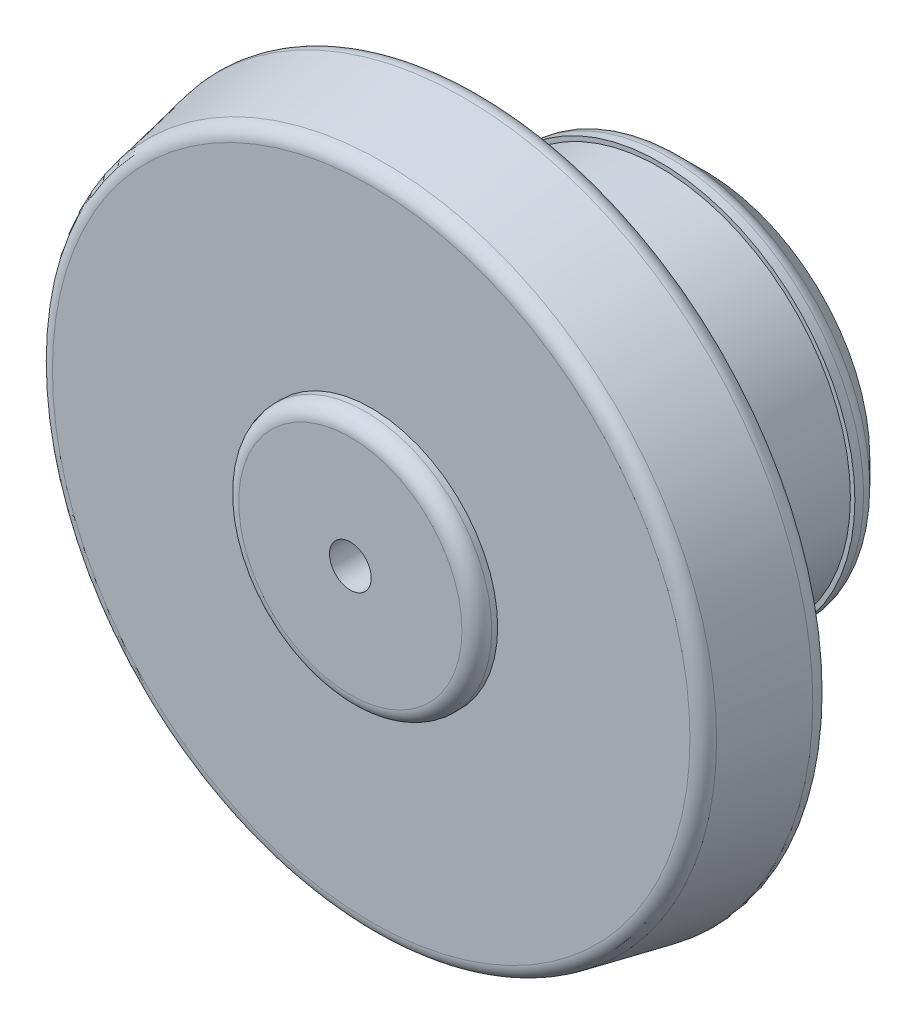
ISO-10303-21;
HEADER;
FILE_DESCRIPTION(('STEP AP214'),'2;1');
FILE_NAME('part.step','',(''),(''),'','','');
FILE_SCHEMA(('AUTOMOTIVE_DESIGN { 1 0 10303 214 1 1 1 1 }'));
ENDSEC;
DATA;
#1=APPLICATION_CONTEXT('core data for automotive mechanical design processes');
#2=APPLICATION_PROTOCOL_DEFINITION('international standard','automotive_design',2000,#1);
#3=PRODUCT_CONTEXT('',#1,'mechanical');
#4=PRODUCT('Part','Part','',(#3));
#5=PRODUCT_RELATED_PRODUCT_CATEGORY('part','',(#4));
#6=PRODUCT_DEFINITION_FORMATION('','',#4);
#7=PRODUCT_DEFINITION_CONTEXT('part definition',#1,'design');
#8=PRODUCT_DEFINITION('design','',#6,#7);
#9=PRODUCT_DEFINITION_SHAPE('','',#8);
#10=(LENGTH_UNIT() NAMED_UNIT(*) SI_UNIT(.MILLI.,.METRE.));
#11=(NAMED_UNIT(*) PLANE_ANGLE_UNIT() SI_UNIT($,.RADIAN.));
#12=(NAMED_UNIT(*) SI_UNIT($,.STERADIAN.) SOLID_ANGLE_UNIT());
#13=UNCERTAINTY_MEASURE_WITH_UNIT(LENGTH_MEASURE(1.E-05),#10,'distance_accuracy_value','');
#14=(GEOMETRIC_REPRESENTATION_CONTEXT(3) GLOBAL_UNCERTAINTY_ASSIGNED_CONTEXT((#13)) GLOBAL_UNIT_ASSIGNED_CONTEXT((#10,
#11,#12)) REPRESENTATION_CONTEXT('',''));
#15=CARTESIAN_POINT('',(0.,0.,0.));
#16=DIRECTION('',(0.,0.,1.));
#17=DIRECTION('',(1.,0.,0.));
#18=AXIS2_PLACEMENT_3D('',#15,#16,#17);
#19=CARTESIAN_POINT('',(0.,0.,7.));
#20=DIRECTION('',(0.,0.,-1.));
#21=DIRECTION('',(-1.,0.,0.));
#22=AXIS2_PLACEMENT_3D('',#19,#20,#21);
#23=PLANE('',#22);
#24=CARTESIAN_POINT('',(0.,0.,7.));
#25=DIRECTION('',(0.,0.,-1.));
#26=DIRECTION('',(-1.,0.,0.));
#27=AXIS2_PLACEMENT_3D('',#24,#25,#26);
#28=CIRCLE('',#27,5.);
#29=CARTESIAN_POINT('',(4.99774949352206,-0.15,7.));
#30=VERTEX_POINT('',#29);
#31=CARTESIAN_POINT('',(0.150000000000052,-4.99774949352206,7.));
#32=VERTEX_POINT('',#31);
#33=EDGE_CURVE('E237',#30,#32,#28,.T.);
#34=ORIENTED_EDGE('',*,*,#33,.T.);
#35=DIRECTION('',(0.,1.,0.));
#36=VECTOR('',#35,1.);
#37=CARTESIAN_POINT('',(0.15,0.,7.));
#38=LINE('',#37,#36);
#39=CARTESIAN_POINT('',(0.150000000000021,-1.99436706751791,7.));
#40=VERTEX_POINT('',#39);
#41=EDGE_CURVE('E161',#32,#40,#38,.T.);
#42=ORIENTED_EDGE('',*,*,#41,.T.);
#43=CARTESIAN_POINT('',(0.,0.,7.));
#44=DIRECTION('',(0.,0.,-1.));
#45=DIRECTION('',(-1.,0.,0.));
#46=AXIS2_PLACEMENT_3D('',#43,#44,#45);
#47=CIRCLE('',#46,2.);
#48=CARTESIAN_POINT('',(1.99436706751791,-0.15,7.));
#49=VERTEX_POINT('',#48);
#50=EDGE_CURVE('E225',#49,#40,#47,.T.);
#51=ORIENTED_EDGE('',*,*,#50,.F.);
#52=DIRECTION('',(-1.,0.,0.));
#53=VECTOR('',#52,1.);
#54=CARTESIAN_POINT('',(0.,-0.15,7.));
#55=LINE('',#54,#53);
#56=EDGE_CURVE('E209',#30,#49,#55,.T.);
#57=ORIENTED_EDGE('',*,*,#56,.F.);
#58=EDGE_LOOP('',(#34,#42,#51,#57));
#59=FACE_BOUND('',#58,.T.);
#60=ADVANCED_FACE('F27',(#59),#23,.T.);
#61=CARTESIAN_POINT('',(0.,0.,7.));
#62=DIRECTION('',(0.,0.,-1.));
#63=DIRECTION('',(-1.,0.,0.));
#64=AXIS2_PLACEMENT_3D('',#61,#62,#63);
#65=CYLINDRICAL_SURFACE('',#64,5.);
#66=CARTESIAN_POINT('',(0.,0.,0.));
#67=DIRECTION('',(0.,0.,-1.));
#68=DIRECTION('',(-1.,0.,0.));
#69=AXIS2_PLACEMENT_3D('',#66,#67,#68);
#70=CIRCLE('',#69,5.);
#71=CARTESIAN_POINT('',(-5.,0.,0.));
#72=VERTEX_POINT('',#71);
#73=EDGE_CURVE('E233',#72,#72,#70,.T.);
#74=ORIENTED_EDGE('',*,*,#73,.T.);
#75=EDGE_LOOP('',(#74));
#76=FACE_BOUND('',#75,.T.);
#77=DIRECTION('',(0.,0.,-1.));
#78=VECTOR('',#77,1.);
#79=CARTESIAN_POINT('',(0.150000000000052,-4.99774949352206,7.));
#80=LINE('',#79,#78);
#81=CARTESIAN_POINT('',(0.150000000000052,-4.99774949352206,1.66008855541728));
#82=VERTEX_POINT('',#81);
#83=EDGE_CURVE('E151',#32,#82,#80,.T.);
#84=ORIENTED_EDGE('',*,*,#83,.F.);
#85=ORIENTED_EDGE('',*,*,#33,.F.);
#86=DIRECTION('',(0.,0.,-1.));
#87=VECTOR('',#86,1.);
#88=CARTESIAN_POINT('',(4.99774949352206,-0.15,7.));
#89=LINE('',#88,#87);
#90=CARTESIAN_POINT('',(4.99774949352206,-0.15,1.66008855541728));
#91=VERTEX_POINT('',#90);
#92=EDGE_CURVE('E211',#30,#91,#89,.T.);
#93=ORIENTED_EDGE('',*,*,#92,.T.);
#94=CARTESIAN_POINT('',(0.,0.,1.66008855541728));
#95=DIRECTION('',(0.,0.,1.));
#96=DIRECTION('',(1.,0.,0.));
#97=AXIS2_PLACEMENT_3D('',#94,#95,#96);
#98=CIRCLE('',#97,5.);
#99=CARTESIAN_POINT('',(4.99774949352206,0.15,1.66008855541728));
#100=VERTEX_POINT('',#99);
#101=EDGE_CURVE('E219',#100,#91,#98,.F.);
#102=ORIENTED_EDGE('',*,*,#101,.F.);
#103=DIRECTION('',(0.,0.,-1.));
#104=VECTOR('',#103,1.);
#105=CARTESIAN_POINT('',(4.99774949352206,0.15,7.));
#106=LINE('',#105,#104);
#107=CARTESIAN_POINT('',(4.99774949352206,0.15,7.));
#108=VERTEX_POINT('',#107);
#109=EDGE_CURVE('E217',#108,#100,#106,.T.);
#110=ORIENTED_EDGE('',*,*,#109,.F.);
#111=CARTESIAN_POINT('',(0.149999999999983,4.99774949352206,7.));
#112=VERTEX_POINT('',#111);
#113=EDGE_CURVE('E236',#112,#108,#28,.T.);
#114=ORIENTED_EDGE('',*,*,#113,.F.);
#115=DIRECTION('',(0.,0.,-1.));
#116=VECTOR('',#115,1.);
#117=CARTESIAN_POINT('',(0.149999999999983,4.99774949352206,7.));
#118=LINE('',#117,#116);
#119=CARTESIAN_POINT('',(0.149999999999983,4.99774949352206,1.66008855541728));
#120=VERTEX_POINT('',#119);
#121=EDGE_CURVE('E193',#112,#120,#118,.T.);
#122=ORIENTED_EDGE('',*,*,#121,.T.);
#123=CARTESIAN_POINT('',(0.,0.,1.66008855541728));
#124=DIRECTION('',(0.,0.,1.));
#125=DIRECTION('',(1.,0.,0.));
#126=AXIS2_PLACEMENT_3D('',#123,#124,#125);
#127=CIRCLE('',#126,5.);
#128=CARTESIAN_POINT('',(-0.150000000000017,4.99774949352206,1.66008855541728));
#129=VERTEX_POINT('',#128);
#130=EDGE_CURVE('E201',#129,#120,#127,.F.);
#131=ORIENTED_EDGE('',*,*,#130,.F.);
#132=DIRECTION('',(0.,0.,-1.));
#133=VECTOR('',#132,1.);
#134=CARTESIAN_POINT('',(-0.150000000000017,4.99774949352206,7.));
#135=LINE('',#134,#133);
#136=CARTESIAN_POINT('',(-0.150000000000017,4.99774949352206,7.));
#137=VERTEX_POINT('',#136);
#138=EDGE_CURVE('E199',#137,#129,#135,.T.);
#139=ORIENTED_EDGE('',*,*,#138,.F.);
#140=CARTESIAN_POINT('',(-4.99774949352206,0.149999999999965,7.));
#141=VERTEX_POINT('',#140);
#142=EDGE_CURVE('E337',#141,#137,#28,.T.);
#143=ORIENTED_EDGE('',*,*,#142,.F.);
#144=DIRECTION('',(0.,0.,-1.));
#145=VECTOR('',#144,1.);
#146=CARTESIAN_POINT('',(-4.99774949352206,0.149999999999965,7.));
#147=LINE('',#146,#145);
#148=CARTESIAN_POINT('',(-4.99774949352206,0.149999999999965,1.66008855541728));
#149=VERTEX_POINT('',#148);
#150=EDGE_CURVE('E175',#141,#149,#147,.T.);
#151=ORIENTED_EDGE('',*,*,#150,.T.);
#152=CARTESIAN_POINT('',(0.,0.,1.66008855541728));
#153=DIRECTION('',(0.,0.,1.));
#154=DIRECTION('',(1.,0.,0.));
#155=AXIS2_PLACEMENT_3D('',#152,#153,#154);
#156=CIRCLE('',#155,5.);
#157=CARTESIAN_POINT('',(-4.99774949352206,-0.150000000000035,1.66008855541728));
#158=VERTEX_POINT('',#157);
#159=EDGE_CURVE('E183',#158,#149,#156,.F.);
#160=ORIENTED_EDGE('',*,*,#159,.F.);
#161=DIRECTION('',(0.,0.,-1.));
#162=VECTOR('',#161,1.);
#163=CARTESIAN_POINT('',(-4.99774949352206,-0.150000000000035,7.));
#164=LINE('',#163,#162);
#165=CARTESIAN_POINT('',(-4.99774949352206,-0.150000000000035,7.));
#166=VERTEX_POINT('',#165);
#167=EDGE_CURVE('E181',#166,#158,#164,.T.);
#168=ORIENTED_EDGE('',*,*,#167,.F.);
#169=CARTESIAN_POINT('',(-0.149999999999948,-4.99774949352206,7.));
#170=VERTEX_POINT('',#169);
#171=EDGE_CURVE('E160',#170,#166,#28,.T.);
#172=ORIENTED_EDGE('',*,*,#171,.F.);
#173=DIRECTION('',(0.,0.,-1.));
#174=VECTOR('',#173,1.);
#175=CARTESIAN_POINT('',(-0.149999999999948,-4.99774949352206,7.));
#176=LINE('',#175,#174);
#177=CARTESIAN_POINT('',(-0.149999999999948,-4.99774949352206,1.66008855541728));
#178=VERTEX_POINT('',#177);
#179=EDGE_CURVE('E154',#170,#178,#176,.T.);
#180=ORIENTED_EDGE('',*,*,#179,.T.);
#181=CARTESIAN_POINT('',(0.,0.,1.66008855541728));
#182=DIRECTION('',(0.,0.,1.));
#183=DIRECTION('',(1.,0.,0.));
#184=AXIS2_PLACEMENT_3D('',#181,#182,#183);
#185=CIRCLE('',#184,5.);
#186=EDGE_CURVE('E140',#82,#178,#185,.F.);
#187=ORIENTED_EDGE('',*,*,#186,.F.);
#188=EDGE_LOOP('',(#84,#85,#93,#102,#110,#114,#122,#131,#139,#143,#151,#160,#168,#172,#180,#187));
#189=FACE_BOUND('',#188,.T.);
#190=ADVANCED_FACE('F158',(#76,#189),#65,.F.);
#191=CARTESIAN_POINT('',(0.,0.,1.));
#192=DIRECTION('',(0.,0.,1.));
#193=DIRECTION('',(1.,0.,0.));
#194=AXIS2_PLACEMENT_3D('',#191,#192,#193);
#195=CYLINDRICAL_SURFACE('',#194,2.);
#196=CARTESIAN_POINT('',(0.,0.,1.));
#197=DIRECTION('',(0.,0.,-1.));
#198=DIRECTION('',(-1.,0.,0.));
#199=AXIS2_PLACEMENT_3D('',#196,#197,#198);
#200=CIRCLE('',#199,2.);
#201=CARTESIAN_POINT('',(-2.,0.,1.));
#202=VERTEX_POINT('',#201);
#203=EDGE_CURVE('E228',#202,#202,#200,.T.);
#204=ORIENTED_EDGE('',*,*,#203,.F.);
#205=EDGE_LOOP('',(#204));
#206=FACE_BOUND('',#205,.T.);
#207=DIRECTION('',(0.,0.,1.));
#208=VECTOR('',#207,1.);
#209=CARTESIAN_POINT('',(0.150000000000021,-1.99436706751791,1.));
#210=LINE('',#209,#208);
#211=CARTESIAN_POINT('',(0.150000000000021,-1.99436706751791,1.66008855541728));
#212=VERTEX_POINT('',#211);
#213=EDGE_CURVE('E11',#212,#40,#210,.T.);
#214=ORIENTED_EDGE('',*,*,#213,.F.);
#215=CARTESIAN_POINT('',(0.,0.,1.66008855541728));
#216=DIRECTION('',(0.,0.,1.));
#217=DIRECTION('',(1.,0.,0.));
#218=AXIS2_PLACEMENT_3D('',#215,#216,#217);
#219=CIRCLE('',#218,2.);
#220=CARTESIAN_POINT('',(-0.149999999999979,-1.99436706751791,1.66008855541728));
#221=VERTEX_POINT('',#220);
#222=EDGE_CURVE('E35',#221,#212,#219,.T.);
#223=ORIENTED_EDGE('',*,*,#222,.F.);
#224=DIRECTION('',(0.,0.,1.));
#225=VECTOR('',#224,1.);
#226=CARTESIAN_POINT('',(-0.149999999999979,-1.99436706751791,1.));
#227=LINE('',#226,#225);
#228=CARTESIAN_POINT('',(-0.149999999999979,-1.99436706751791,7.));
#229=VERTEX_POINT('',#228);
#230=EDGE_CURVE('E155',#221,#229,#227,.T.);
#231=ORIENTED_EDGE('',*,*,#230,.T.);
#232=CARTESIAN_POINT('',(-1.99436706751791,-0.150000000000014,7.));
#233=VERTEX_POINT('',#232);
#234=EDGE_CURVE('E229',#229,#233,#47,.T.);
#235=ORIENTED_EDGE('',*,*,#234,.T.);
#236=DIRECTION('',(0.,0.,1.));
#237=VECTOR('',#236,1.);
#238=CARTESIAN_POINT('',(-1.99436706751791,-0.150000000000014,1.));
#239=LINE('',#238,#237);
#240=CARTESIAN_POINT('',(-1.99436706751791,-0.150000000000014,1.66008855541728));
#241=VERTEX_POINT('',#240);
#242=EDGE_CURVE('E307',#241,#233,#239,.T.);
#243=ORIENTED_EDGE('',*,*,#242,.F.);
#244=CARTESIAN_POINT('',(0.,0.,1.66008855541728));
#245=DIRECTION('',(0.,0.,1.));
#246=DIRECTION('',(1.,0.,0.));
#247=AXIS2_PLACEMENT_3D('',#244,#245,#246);
#248=CIRCLE('',#247,2.);
#249=CARTESIAN_POINT('',(-1.99436706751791,0.149999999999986,1.66008855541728));
#250=VERTEX_POINT('',#249);
#251=EDGE_CURVE('E305',#250,#241,#248,.T.);
#252=ORIENTED_EDGE('',*,*,#251,.F.);
#253=DIRECTION('',(0.,0.,1.));
#254=VECTOR('',#253,1.);
#255=CARTESIAN_POINT('',(-1.99436706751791,0.149999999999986,1.));
#256=LINE('',#255,#254);
#257=CARTESIAN_POINT('',(-1.99436706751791,0.149999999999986,7.));
#258=VERTEX_POINT('',#257);
#259=EDGE_CURVE('E303',#250,#258,#256,.T.);
#260=ORIENTED_EDGE('',*,*,#259,.T.);
#261=CARTESIAN_POINT('',(-0.150000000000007,1.99436706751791,7.));
#262=VERTEX_POINT('',#261);
#263=EDGE_CURVE('E357',#258,#262,#47,.T.);
#264=ORIENTED_EDGE('',*,*,#263,.T.);
#265=DIRECTION('',(0.,0.,1.));
#266=VECTOR('',#265,1.);
#267=CARTESIAN_POINT('',(-0.150000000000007,1.99436706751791,1.));
#268=LINE('',#267,#266);
#269=CARTESIAN_POINT('',(-0.150000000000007,1.99436706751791,1.66008855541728));
#270=VERTEX_POINT('',#269);
#271=EDGE_CURVE('E300',#270,#262,#268,.T.);
#272=ORIENTED_EDGE('',*,*,#271,.F.);
#273=CARTESIAN_POINT('',(0.,0.,1.66008855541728));
#274=DIRECTION('',(0.,0.,1.));
#275=DIRECTION('',(1.,0.,0.));
#276=AXIS2_PLACEMENT_3D('',#273,#274,#275);
#277=CIRCLE('',#276,2.);
#278=CARTESIAN_POINT('',(0.149999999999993,1.99436706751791,1.66008855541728));
#279=VERTEX_POINT('',#278);
#280=EDGE_CURVE('E298',#279,#270,#277,.T.);
#281=ORIENTED_EDGE('',*,*,#280,.F.);
#282=DIRECTION('',(0.,0.,1.));
#283=VECTOR('',#282,1.);
#284=CARTESIAN_POINT('',(0.149999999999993,1.99436706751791,1.));
#285=LINE('',#284,#283);
#286=CARTESIAN_POINT('',(0.149999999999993,1.99436706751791,7.));
#287=VERTEX_POINT('',#286);
#288=EDGE_CURVE('E295',#279,#287,#285,.T.);
#289=ORIENTED_EDGE('',*,*,#288,.T.);
#290=CARTESIAN_POINT('',(1.99436706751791,0.15,7.));
#291=VERTEX_POINT('',#290);
#292=EDGE_CURVE('E230',#287,#291,#47,.T.);
#293=ORIENTED_EDGE('',*,*,#292,.T.);
#294=DIRECTION('',(0.,0.,1.));
#295=VECTOR('',#294,1.);
#296=CARTESIAN_POINT('',(1.99436706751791,0.15,1.));
#297=LINE('',#296,#295);
#298=CARTESIAN_POINT('',(1.99436706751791,0.15,1.66008855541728));
#299=VERTEX_POINT('',#298);
#300=EDGE_CURVE('E292',#299,#291,#297,.T.);
#301=ORIENTED_EDGE('',*,*,#300,.F.);
#302=CARTESIAN_POINT('',(0.,0.,1.66008855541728));
#303=DIRECTION('',(0.,0.,1.));
#304=DIRECTION('',(1.,0.,0.));
#305=AXIS2_PLACEMENT_3D('',#302,#303,#304);
#306=CIRCLE('',#305,2.);
#307=CARTESIAN_POINT('',(1.99436706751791,-0.15,1.66008855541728));
#308=VERTEX_POINT('',#307);
#309=EDGE_CURVE('E290',#308,#299,#306,.T.);
#310=ORIENTED_EDGE('',*,*,#309,.F.);
#311=DIRECTION('',(0.,0.,1.));
#312=VECTOR('',#311,1.);
#313=CARTESIAN_POINT('',(1.99436706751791,-0.15,1.));
#314=LINE('',#313,#312);
#315=EDGE_CURVE('E285',#308,#49,#314,.T.);
#316=ORIENTED_EDGE('',*,*,#315,.T.);
#317=ORIENTED_EDGE('',*,*,#50,.T.);
#318=EDGE_LOOP('',(#214,#223,#231,#235,#243,#252,#260,#264,#272,#281,#289,#293,#301,#310,#316,#317));
#319=FACE_BOUND('',#318,.T.);
#320=ADVANCED_FACE('F314',(#206,#319),#195,.T.);
#321=DIRECTION('',(0.,1.,0.));
#322=VECTOR('',#321,1.);
#323=CARTESIAN_POINT('',(-0.15,0.,7.));
#324=LINE('',#323,#322);
#325=EDGE_CURVE('E42',#170,#229,#324,.T.);
#326=ORIENTED_EDGE('',*,*,#325,.F.);
#327=ORIENTED_EDGE('',*,*,#171,.T.);
#328=DIRECTION('',(1.,0.,0.));
#329=VECTOR('',#328,1.);
#330=CARTESIAN_POINT('',(0.,-0.15,7.));
#331=LINE('',#330,#329);
#332=EDGE_CURVE('E178',#166,#233,#331,.T.);
#333=ORIENTED_EDGE('',*,*,#332,.T.);
#334=ORIENTED_EDGE('',*,*,#234,.F.);
#335=EDGE_LOOP('',(#326,#327,#333,#334));
#336=FACE_BOUND('',#335,.T.);
#337=ADVANCED_FACE('F343',(#336),#23,.T.);
#338=DIRECTION('',(1.,0.,0.));
#339=VECTOR('',#338,1.);
#340=CARTESIAN_POINT('',(0.,0.15,7.));
#341=LINE('',#340,#339);
#342=EDGE_CURVE('E50',#141,#258,#341,.T.);
#343=ORIENTED_EDGE('',*,*,#342,.F.);
#344=ORIENTED_EDGE('',*,*,#142,.T.);
#345=DIRECTION('',(0.,-1.,0.));
#346=VECTOR('',#345,1.);
#347=CARTESIAN_POINT('',(-0.15,0.,7.));
#348=LINE('',#347,#346);
#349=EDGE_CURVE('E196',#137,#262,#348,.T.);
#350=ORIENTED_EDGE('',*,*,#349,.T.);
#351=ORIENTED_EDGE('',*,*,#263,.F.);
#352=EDGE_LOOP('',(#343,#344,#350,#351));
#353=FACE_BOUND('',#352,.T.);
#354=ADVANCED_FACE('F358',(#353),#23,.T.);
#355=DIRECTION('',(0.,-1.,0.));
#356=VECTOR('',#355,1.);
#357=CARTESIAN_POINT('',(0.15,0.,7.));
#358=LINE('',#357,#356);
#359=EDGE_CURVE('E191',#112,#287,#358,.T.);
#360=ORIENTED_EDGE('',*,*,#359,.F.);
#361=ORIENTED_EDGE('',*,*,#113,.T.);
#362=DIRECTION('',(-1.,0.,0.));
#363=VECTOR('',#362,1.);
#364=CARTESIAN_POINT('',(0.,0.15,7.));
#365=LINE('',#364,#363);
#366=EDGE_CURVE('E214',#108,#291,#365,.T.);
#367=ORIENTED_EDGE('',*,*,#366,.T.);
#368=ORIENTED_EDGE('',*,*,#292,.F.);
#369=EDGE_LOOP('',(#360,#361,#367,#368));
#370=FACE_BOUND('',#369,.T.);
#371=ADVANCED_FACE('F335',(#370),#23,.T.);
#372=CARTESIAN_POINT('',(0.,0.,1.5));
#373=DIRECTION('',(0.,0.,1.));
#374=DIRECTION('',(1.,0.,0.));
#375=AXIS2_PLACEMENT_3D('',#372,#373,#374);
#376=PLANE('',#375);
#377=CARTESIAN_POINT('',(0.,0.,1.5));
#378=DIRECTION('',(0.,0.,1.));
#379=DIRECTION('',(1.,0.,0.));
#380=AXIS2_PLACEMENT_3D('',#377,#378,#379);
#381=CIRCLE('',#380,6.55);
#382=CARTESIAN_POINT('',(6.55,0.,1.5));
#383=VERTEX_POINT('',#382);
#384=EDGE_CURVE('E255',#383,#383,#381,.T.);
#385=ORIENTED_EDGE('',*,*,#384,.T.);
#386=EDGE_LOOP('',(#385));
#387=FACE_BOUND('',#386,.T.);
#388=CARTESIAN_POINT('',(0.,0.,1.5));
#389=DIRECTION('',(0.,0.,1.));
#390=DIRECTION('',(1.,0.,0.));
#391=AXIS2_PLACEMENT_3D('',#388,#389,#390);
#392=CIRCLE('',#391,6.4);
#393=CARTESIAN_POINT('',(6.4,0.,1.5));
#394=VERTEX_POINT('',#393);
#395=EDGE_CURVE('E252',#394,#394,#392,.T.);
#396=ORIENTED_EDGE('',*,*,#395,.F.);
#397=EDGE_LOOP('',(#396));
#398=FACE_BOUND('',#397,.T.);
#399=ADVANCED_FACE('F389',(#387,#398),#376,.T.);
#400=CARTESIAN_POINT('',(0.,0.,1.5));
#401=DIRECTION('',(0.,0.,-1.));
#402=DIRECTION('',(-1.,0.,0.));
#403=AXIS2_PLACEMENT_3D('',#400,#401,#402);
#404=CYLINDRICAL_SURFACE('',#403,6.55);
#405=CARTESIAN_POINT('',(0.,0.,1.20710678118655));
#406=DIRECTION('',(0.,0.,-1.));
#407=DIRECTION('',(-1.,0.,0.));
#408=AXIS2_PLACEMENT_3D('',#405,#406,#407);
#409=CIRCLE('',#408,6.55);
#410=CARTESIAN_POINT('',(-6.55,0.,1.20710678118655));
#411=VERTEX_POINT('',#410);
#412=EDGE_CURVE('E261',#411,#411,#409,.F.);
#413=ORIENTED_EDGE('',*,*,#412,.T.);
#414=EDGE_LOOP('',(#413));
#415=FACE_BOUND('',#414,.T.);
#416=ORIENTED_EDGE('',*,*,#384,.F.);
#417=EDGE_LOOP('',(#416));
#418=FACE_BOUND('',#417,.T.);
#419=ADVANCED_FACE('F29',(#415,#418),#404,.T.);
#420=CARTESIAN_POINT('',(0.,0.,0.));
#421=DIRECTION('',(0.,0.,1.));
#422=DIRECTION('',(1.,0.,0.));
#423=AXIS2_PLACEMENT_3D('',#420,#421,#422);
#424=PLANE('',#423);
#425=ORIENTED_EDGE('',*,*,#73,.F.);
#426=EDGE_LOOP('',(#425));
#427=FACE_BOUND('',#426,.T.);
#428=CARTESIAN_POINT('',(0.,0.,0.));
#429=DIRECTION('',(0.,0.,1.));
#430=DIRECTION('',(1.,0.,0.));
#431=AXIS2_PLACEMENT_3D('',#428,#429,#430);
#432=CIRCLE('',#431,5.55);
#433=CARTESIAN_POINT('',(5.55,0.,0.));
#434=VERTEX_POINT('',#433);
#435=EDGE_CURVE('E258',#434,#434,#432,.F.);
#436=ORIENTED_EDGE('',*,*,#435,.T.);
#437=EDGE_LOOP('',(#436));
#438=FACE_BOUND('',#437,.T.);
#439=ADVANCED_FACE('F540',(#427,#438),#424,.F.);
#440=CARTESIAN_POINT('',(0.,0.,7.5));
#441=DIRECTION('',(0.,0.,-1.));
#442=DIRECTION('',(-1.,0.,0.));
#443=AXIS2_PLACEMENT_3D('',#440,#441,#442);
#444=CYLINDRICAL_SURFACE('',#443,6.4);
#445=ORIENTED_EDGE('',*,*,#395,.T.);
#446=EDGE_LOOP('',(#445));
#447=FACE_BOUND('',#446,.T.);
#448=CARTESIAN_POINT('',(0.,0.,8.95));
#449=DIRECTION('',(0.,0.,-1.));
#450=DIRECTION('',(-1.,0.,0.));
#451=AXIS2_PLACEMENT_3D('',#448,#449,#450);
#452=CIRCLE('',#451,6.4);
#453=CARTESIAN_POINT('',(-6.4,0.,8.95));
#454=VERTEX_POINT('',#453);
#455=EDGE_CURVE('E246',#454,#454,#452,.T.);
#456=ORIENTED_EDGE('',*,*,#455,.T.);
#457=EDGE_LOOP('',(#456));
#458=FACE_BOUND('',#457,.T.);
#459=ADVANCED_FACE('F536',(#447,#458),#444,.T.);
#460=CARTESIAN_POINT('',(0.,0.,1.));
#461=DIRECTION('',(0.,0.,1.));
#462=DIRECTION('',(1.,0.,0.));
#463=AXIS2_PLACEMENT_3D('',#460,#461,#462);
#464=CONICAL_SURFACE('',#463,6.55,0.78539816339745);
#465=CARTESIAN_POINT('',(0.,0.,0.853553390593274));
#466=DIRECTION('',(0.,0.,1.));
#467=DIRECTION('',(1.,0.,0.));
#468=AXIS2_PLACEMENT_3D('',#465,#466,#467);
#469=CIRCLE('',#468,6.40355339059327);
#470=CARTESIAN_POINT('',(6.40355339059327,0.,0.853553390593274));
#471=VERTEX_POINT('',#470);
#472=EDGE_CURVE('E264',#471,#471,#469,.F.);
#473=ORIENTED_EDGE('',*,*,#472,.T.);
#474=EDGE_LOOP('',(#473));
#475=FACE_BOUND('',#474,.T.);
#476=ORIENTED_EDGE('',*,*,#435,.F.);
#477=EDGE_LOOP('',(#476));
#478=FACE_BOUND('',#477,.T.);
#479=ADVANCED_FACE('F522',(#475,#478),#464,.T.);
#480=CARTESIAN_POINT('',(-6.4,0.,8.95));
#481=DIRECTION('',(0.,0.,1.));
#482=DIRECTION('',(1.,0.,0.));
#483=AXIS2_PLACEMENT_3D('',#480,#481,#482);
#484=PLANE('',#483);
#485=ORIENTED_EDGE('',*,*,#455,.F.);
#486=EDGE_LOOP('',(#485));
#487=FACE_BOUND('',#486,.T.);
#488=CARTESIAN_POINT('',(0.,0.,8.95));
#489=DIRECTION('',(0.,0.,-1.));
#490=DIRECTION('',(-1.,0.,0.));
#491=AXIS2_PLACEMENT_3D('',#488,#489,#490);
#492=CIRCLE('',#491,9.6);
#493=CARTESIAN_POINT('',(-9.6,0.,8.95));
#494=VERTEX_POINT('',#493);
#495=EDGE_CURVE('E243',#494,#494,#492,.T.);
#496=ORIENTED_EDGE('',*,*,#495,.T.);
#497=EDGE_LOOP('',(#496));
#498=FACE_BOUND('',#497,.T.);
#499=ADVANCED_FACE('F519',(#487,#498),#484,.F.);
#500=CARTESIAN_POINT('',(0.,0.,-80.9));
#501=DIRECTION('',(0.,0.,-1.));
#502=DIRECTION('',(-1.,0.,0.));
#503=AXIS2_PLACEMENT_3D('',#500,#501,#502);
#504=CYLINDRICAL_SURFACE('',#503,9.6);
#505=ORIENTED_EDGE('',*,*,#495,.F.);
#506=EDGE_LOOP('',(#505));
#507=FACE_BOUND('',#506,.T.);
#508=CARTESIAN_POINT('',(0.,0.,7.49999999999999));
#509=DIRECTION('',(0.,0.,-1.));
#510=DIRECTION('',(-1.,0.,0.));
#511=AXIS2_PLACEMENT_3D('',#508,#509,#510);
#512=CIRCLE('',#511,9.6);
#513=CARTESIAN_POINT('',(-9.6,0.,7.49999999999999));
#514=VERTEX_POINT('',#513);
#515=EDGE_CURVE('E240',#514,#514,#512,.T.);
#516=ORIENTED_EDGE('',*,*,#515,.T.);
#517=EDGE_LOOP('',(#516));
#518=FACE_BOUND('',#517,.T.);
#519=ADVANCED_FACE('F516',(#507,#518),#504,.F.);
#520=CARTESIAN_POINT('',(0.,0.,7.5));
#521=DIRECTION('',(0.,0.,1.));
#522=DIRECTION('',(1.,0.,0.));
#523=AXIS2_PLACEMENT_3D('',#520,#521,#522);
#524=PLANE('',#523);
#525=CARTESIAN_POINT('',(0.,0.,7.5));
#526=DIRECTION('',(0.,0.,1.));
#527=DIRECTION('',(1.,0.,0.));
#528=AXIS2_PLACEMENT_3D('',#525,#526,#527);
#529=CIRCLE('',#528,11.2418928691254);
#530=CARTESIAN_POINT('',(11.2418928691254,0.,7.5));
#531=VERTEX_POINT('',#530);
#532=EDGE_CURVE('E267',#531,#531,#529,.F.);
#533=ORIENTED_EDGE('',*,*,#532,.T.);
#534=EDGE_LOOP('',(#533));
#535=FACE_BOUND('',#534,.T.);
#536=ORIENTED_EDGE('',*,*,#515,.F.);
#537=EDGE_LOOP('',(#536));
#538=FACE_BOUND('',#537,.T.);
#539=ADVANCED_FACE('F514',(#535,#538),#524,.F.);
#540=CARTESIAN_POINT('',(0.,0.,11.2));
#541=DIRECTION('',(0.,0.,-1.));
#542=DIRECTION('',(-1.,0.,0.));
#543=AXIS2_PLACEMENT_3D('',#540,#541,#542);
#544=CONICAL_SURFACE('',#543,11.1211171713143,0.194504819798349);
#545=CARTESIAN_POINT('',(0.,0.,8.09664035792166));
#546=DIRECTION('',(0.,0.,1.));
#547=DIRECTION('',(1.,0.,0.));
#548=AXIS2_PLACEMENT_3D('',#545,#546,#547);
#549=CIRCLE('',#548,11.7324646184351);
#550=CARTESIAN_POINT('',(11.7324646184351,0.,8.09664035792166));
#551=VERTEX_POINT('',#550);
#552=EDGE_CURVE('E273',#551,#551,#549,.T.);
#553=ORIENTED_EDGE('',*,*,#552,.T.);
#554=EDGE_LOOP('',(#553));
#555=FACE_BOUND('',#554,.T.);
#556=CARTESIAN_POINT('',(0.,0.,10.7966403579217));
#557=DIRECTION('',(0.,0.,-1.));
#558=DIRECTION('',(-1.,0.,0.));
#559=AXIS2_PLACEMENT_3D('',#556,#557,#558);
#560=CIRCLE('',#559,11.2005771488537);
#561=CARTESIAN_POINT('',(-11.2005771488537,0.,10.7966403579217));
#562=VERTEX_POINT('',#561);
#563=EDGE_CURVE('E270',#562,#562,#560,.T.);
#564=ORIENTED_EDGE('',*,*,#563,.T.);
#565=EDGE_LOOP('',(#564));
#566=FACE_BOUND('',#565,.T.);
#567=ADVANCED_FACE('F492',(#555,#566),#544,.T.);
#568=CARTESIAN_POINT('',(0.,0.,11.9));
#569=DIRECTION('',(0.,0.,1.));
#570=DIRECTION('',(1.,0.,0.));
#571=AXIS2_PLACEMENT_3D('',#568,#569,#570);
#572=PLANE('',#571);
#573=CARTESIAN_POINT('',(0.,0.,11.9));
#574=DIRECTION('',(0.,0.,-1.));
#575=DIRECTION('',(-1.,0.,0.));
#576=AXIS2_PLACEMENT_3D('',#573,#574,#575);
#577=CIRCLE('',#576,0.7);
#578=CARTESIAN_POINT('',(-0.7,0.,11.9));
#579=VERTEX_POINT('',#578);
#580=EDGE_CURVE('E221',#579,#579,#577,.T.);
#581=ORIENTED_EDGE('',*,*,#580,.T.);
#582=EDGE_LOOP('',(#581));
#583=FACE_BOUND('',#582,.T.);
#584=CARTESIAN_POINT('',(0.,0.,11.9));
#585=DIRECTION('',(0.,0.,1.));
#586=DIRECTION('',(1.,0.,0.));
#587=AXIS2_PLACEMENT_3D('',#584,#585,#586);
#588=CIRCLE('',#587,3.75);
#589=CARTESIAN_POINT('',(3.75,0.,11.9));
#590=VERTEX_POINT('',#589);
#591=EDGE_CURVE('E276',#590,#590,#588,.T.);
#592=ORIENTED_EDGE('',*,*,#591,.T.);
#593=EDGE_LOOP('',(#592));
#594=FACE_BOUND('',#593,.T.);
#595=ADVANCED_FACE('F489',(#583,#594),#572,.T.);
#596=CARTESIAN_POINT('',(0.,0.,11.9));
#597=DIRECTION('',(0.,0.,-1.));
#598=DIRECTION('',(-1.,0.,0.));
#599=AXIS2_PLACEMENT_3D('',#596,#597,#598);
#600=CYLINDRICAL_SURFACE('',#599,4.25);
#601=CARTESIAN_POINT('',(0.,0.,11.4));
#602=DIRECTION('',(0.,0.,1.));
#603=DIRECTION('',(1.,0.,0.));
#604=AXIS2_PLACEMENT_3D('',#601,#602,#603);
#605=CIRCLE('',#604,4.25);
#606=CARTESIAN_POINT('',(4.25,0.,11.4));
#607=VERTEX_POINT('',#606);
#608=EDGE_CURVE('E279',#607,#607,#605,.F.);
#609=ORIENTED_EDGE('',*,*,#608,.T.);
#610=EDGE_LOOP('',(#609));
#611=FACE_BOUND('',#610,.T.);
#612=CARTESIAN_POINT('',(0.,0.,11.2));
#613=DIRECTION('',(0.,0.,1.));
#614=DIRECTION('',(1.,0.,0.));
#615=AXIS2_PLACEMENT_3D('',#612,#613,#614);
#616=CIRCLE('',#615,4.25);
#617=CARTESIAN_POINT('',(4.25,0.,11.2));
#618=VERTEX_POINT('',#617);
#619=EDGE_CURVE('E249',#618,#618,#616,.T.);
#620=ORIENTED_EDGE('',*,*,#619,.T.);
#621=EDGE_LOOP('',(#620));
#622=FACE_BOUND('',#621,.T.);
#623=ADVANCED_FACE('F491',(#611,#622),#600,.T.);
#624=CARTESIAN_POINT('',(0.,0.,11.2));
#625=DIRECTION('',(0.,0.,1.));
#626=DIRECTION('',(1.,0.,0.));
#627=AXIS2_PLACEMENT_3D('',#624,#625,#626);
#628=PLANE('',#627);
#629=CARTESIAN_POINT('',(0.,0.,11.2));
#630=DIRECTION('',(0.,0.,1.));
#631=DIRECTION('',(1.,0.,0.));
#632=AXIS2_PLACEMENT_3D('',#629,#630,#631);
#633=CIRCLE('',#632,10.710005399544);
#634=CARTESIAN_POINT('',(10.710005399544,0.,11.2));
#635=VERTEX_POINT('',#634);
#636=EDGE_CURVE('E282',#635,#635,#633,.T.);
#637=ORIENTED_EDGE('',*,*,#636,.T.);
#638=EDGE_LOOP('',(#637));
#639=FACE_BOUND('',#638,.T.);
#640=ORIENTED_EDGE('',*,*,#619,.F.);
#641=EDGE_LOOP('',(#640));
#642=FACE_BOUND('',#641,.T.);
#643=ADVANCED_FACE('F510',(#639,#642),#628,.T.);
#644=CARTESIAN_POINT('',(0.,0.,1.20710678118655));
#645=DIRECTION('',(0.,0.,-1.));
#646=DIRECTION('',(-1.,0.,0.));
#647=AXIS2_PLACEMENT_3D('',#644,#645,#646);
#648=TOROIDAL_SURFACE('',#647,6.05,0.5);
#649=ORIENTED_EDGE('',*,*,#472,.F.);
#650=EDGE_LOOP('',(#649));
#651=FACE_BOUND('',#650,.T.);
#652=ORIENTED_EDGE('',*,*,#412,.F.);
#653=EDGE_LOOP('',(#652));
#654=FACE_BOUND('',#653,.T.);
#655=ADVANCED_FACE('F503',(#651,#654),#648,.T.);
#656=CARTESIAN_POINT('',(0.,0.,8.));
#657=DIRECTION('',(0.,0.,1.));
#658=DIRECTION('',(1.,0.,0.));
#659=AXIS2_PLACEMENT_3D('',#656,#657,#658);
#660=TOROIDAL_SURFACE('',#659,11.2418928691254,0.5);
#661=ORIENTED_EDGE('',*,*,#552,.F.);
#662=EDGE_LOOP('',(#661));
#663=FACE_BOUND('',#662,.T.);
#664=ORIENTED_EDGE('',*,*,#532,.F.);
#665=EDGE_LOOP('',(#664));
#666=FACE_BOUND('',#665,.T.);
#667=ADVANCED_FACE('F497',(#663,#666),#660,.T.);
#668=CARTESIAN_POINT('',(0.,0.,11.4));
#669=DIRECTION('',(0.,0.,1.));
#670=DIRECTION('',(1.,0.,0.));
#671=AXIS2_PLACEMENT_3D('',#668,#669,#670);
#672=TOROIDAL_SURFACE('',#671,3.75,0.5);
#673=ORIENTED_EDGE('',*,*,#608,.F.);
#674=EDGE_LOOP('',(#673));
#675=FACE_BOUND('',#674,.T.);
#676=ORIENTED_EDGE('',*,*,#591,.F.);
#677=EDGE_LOOP('',(#676));
#678=FACE_BOUND('',#677,.T.);
#679=ADVANCED_FACE('F480',(#675,#678),#672,.T.);
#680=CARTESIAN_POINT('',(0.,0.,10.7));
#681=DIRECTION('',(0.,0.,1.));
#682=DIRECTION('',(1.,0.,0.));
#683=AXIS2_PLACEMENT_3D('',#680,#681,#682);
#684=TOROIDAL_SURFACE('',#683,10.710005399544,0.5);
#685=ORIENTED_EDGE('',*,*,#636,.F.);
#686=EDGE_LOOP('',(#685));
#687=FACE_BOUND('',#686,.T.);
#688=ORIENTED_EDGE('',*,*,#563,.F.);
#689=EDGE_LOOP('',(#688));
#690=FACE_BOUND('',#689,.T.);
#691=ADVANCED_FACE('F474',(#687,#690),#684,.T.);
#692=CARTESIAN_POINT('',(0.,0.,1.));
#693=DIRECTION('',(0.,0.,-1.));
#694=DIRECTION('',(-1.,0.,0.));
#695=AXIS2_PLACEMENT_3D('',#692,#693,#694);
#696=PLANE('',#695);
#697=CARTESIAN_POINT('',(0.,0.,0.999999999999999));
#698=DIRECTION('',(0.,0.,-1.));
#699=DIRECTION('',(-1.,0.,0.));
#700=AXIS2_PLACEMENT_3D('',#697,#698,#699);
#701=CIRCLE('',#700,0.7);
#702=CARTESIAN_POINT('',(-0.7,0.,1.));
#703=VERTEX_POINT('',#702);
#704=EDGE_CURVE('E224',#703,#703,#701,.T.);
#705=ORIENTED_EDGE('',*,*,#704,.F.);
#706=EDGE_LOOP('',(#705));
#707=FACE_BOUND('',#706,.T.);
#708=ORIENTED_EDGE('',*,*,#203,.T.);
#709=EDGE_LOOP('',(#708));
#710=FACE_BOUND('',#709,.T.);
#711=ADVANCED_FACE('F471',(#707,#710),#696,.T.);
#712=CARTESIAN_POINT('',(0.,0.,11.9));
#713=DIRECTION('',(0.,0.,-1.));
#714=DIRECTION('',(-1.,0.,0.));
#715=AXIS2_PLACEMENT_3D('',#712,#713,#714);
#716=CYLINDRICAL_SURFACE('',#715,0.7);
#717=CARTESIAN_POINT('',(-0.7,0.,1.));
#718=CARTESIAN_POINT('',(-0.7,0.,1.11354166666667));
#719=CARTESIAN_POINT('',(-0.7,0.,1.22708333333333));
#720=CARTESIAN_POINT('',(-0.7,0.,1.45416666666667));
#721=CARTESIAN_POINT('',(-0.7,0.,1.56770833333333));
#722=CARTESIAN_POINT('',(-0.7,0.,1.79479166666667));
#723=CARTESIAN_POINT('',(-0.7,0.,1.90833333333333));
#724=CARTESIAN_POINT('',(-0.7,0.,2.13541666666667));
#725=CARTESIAN_POINT('',(-0.7,0.,2.24895833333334));
#726=CARTESIAN_POINT('',(-0.7,0.,2.47604166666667));
#727=CARTESIAN_POINT('',(-0.7,0.,2.58958333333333));
#728=CARTESIAN_POINT('',(-0.7,0.,2.81666666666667));
#729=CARTESIAN_POINT('',(-0.7,0.,2.93020833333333));
#730=CARTESIAN_POINT('',(-0.7,0.,3.15729166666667));
#731=CARTESIAN_POINT('',(-0.7,0.,3.27083333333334));
#732=CARTESIAN_POINT('',(-0.7,0.,3.49791666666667));
#733=CARTESIAN_POINT('',(-0.7,0.,3.61145833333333));
#734=CARTESIAN_POINT('',(-0.7,0.,3.83854166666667));
#735=CARTESIAN_POINT('',(-0.7,0.,3.95208333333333));
#736=CARTESIAN_POINT('',(-0.7,0.,4.17916666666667));
#737=CARTESIAN_POINT('',(-0.7,0.,4.29270833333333));
#738=CARTESIAN_POINT('',(-0.7,0.,4.51979166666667));
#739=CARTESIAN_POINT('',(-0.7,0.,4.63333333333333));
#740=CARTESIAN_POINT('',(-0.7,0.,4.86041666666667));
#741=CARTESIAN_POINT('',(-0.7,0.,4.97395833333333));
#742=CARTESIAN_POINT('',(-0.7,0.,5.20104166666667));
#743=CARTESIAN_POINT('',(-0.7,0.,5.31458333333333));
#744=CARTESIAN_POINT('',(-0.7,0.,5.54166666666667));
#745=CARTESIAN_POINT('',(-0.7,0.,5.65520833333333));
#746=CARTESIAN_POINT('',(-0.7,0.,5.88229166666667));
#747=CARTESIAN_POINT('',(-0.7,0.,5.99583333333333));
#748=CARTESIAN_POINT('',(-0.7,0.,6.22291666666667));
#749=CARTESIAN_POINT('',(-0.7,0.,6.33645833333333));
#750=CARTESIAN_POINT('',(-0.7,0.,6.56354166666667));
#751=CARTESIAN_POINT('',(-0.7,0.,6.67708333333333));
#752=CARTESIAN_POINT('',(-0.7,0.,6.90416666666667));
#753=CARTESIAN_POINT('',(-0.7,0.,7.01770833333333));
#754=CARTESIAN_POINT('',(-0.7,0.,7.24479166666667));
#755=CARTESIAN_POINT('',(-0.7,0.,7.35833333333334));
#756=CARTESIAN_POINT('',(-0.7,0.,7.58541666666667));
#757=CARTESIAN_POINT('',(-0.7,0.,7.69895833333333));
#758=CARTESIAN_POINT('',(-0.7,0.,7.92604166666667));
#759=CARTESIAN_POINT('',(-0.7,0.,8.03958333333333));
#760=CARTESIAN_POINT('',(-0.7,0.,8.26666666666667));
#761=CARTESIAN_POINT('',(-0.7,0.,8.38020833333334));
#762=CARTESIAN_POINT('',(-0.7,0.,8.60729166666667));
#763=CARTESIAN_POINT('',(-0.7,0.,8.72083333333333));
#764=CARTESIAN_POINT('',(-0.7,0.,8.94791666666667));
#765=CARTESIAN_POINT('',(-0.7,0.,9.06145833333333));
#766=CARTESIAN_POINT('',(-0.7,0.,9.28854166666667));
#767=CARTESIAN_POINT('',(-0.7,0.,9.40208333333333));
#768=CARTESIAN_POINT('',(-0.7,0.,9.62916666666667));
#769=CARTESIAN_POINT('',(-0.7,0.,9.74270833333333));
#770=CARTESIAN_POINT('',(-0.7,0.,9.96979166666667));
#771=CARTESIAN_POINT('',(-0.7,0.,10.0833333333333));
#772=CARTESIAN_POINT('',(-0.7,0.,10.3104166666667));
#773=CARTESIAN_POINT('',(-0.7,0.,10.4239583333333));
#774=CARTESIAN_POINT('',(-0.7,0.,10.6510416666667));
#775=CARTESIAN_POINT('',(-0.7,0.,10.7645833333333));
#776=CARTESIAN_POINT('',(-0.7,0.,10.9916666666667));
#777=CARTESIAN_POINT('',(-0.7,0.,11.1052083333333));
#778=CARTESIAN_POINT('',(-0.7,0.,11.3322916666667));
#779=CARTESIAN_POINT('',(-0.7,0.,11.4458333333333));
#780=CARTESIAN_POINT('',(-0.7,0.,11.6729166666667));
#781=CARTESIAN_POINT('',(-0.7,0.,11.7864583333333));
#782=CARTESIAN_POINT('',(-0.7,0.,11.9));
#783=B_SPLINE_CURVE_WITH_KNOTS('',3,(#717,#718,#719,#720,#721,#722,#723,#724,#725,#726,#727,
#728,#729,#730,#731,#732,#733,#734,#735,#736,#737,#738,#739,#740,#741,#742,#743,#744,#745,#746,
#747,#748,#749,#750,#751,#752,#753,#754,#755,#756,#757,#758,#759,#760,#761,#762,#763,#764,#765,
#766,#767,#768,#769,#770,#771,#772,#773,#774,#775,#776,#777,#778,#779,#780,#781,#782),
.UNSPECIFIED.,.F.,.F.,(4,2,2,2,2,2,2,2,2,2,2,2,2,2,2,2,2,2,2,2,2,2,2,2,2,2,2,2,2,2,2,2,4),(0.,
0.340625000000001,0.68125,1.021875,1.3625,1.703125,2.04375,2.384375,2.725,3.065625,3.40625,
3.746875,4.0875,4.428125,4.76875,5.109375,5.45,5.790625,6.13125,6.471875,6.8125,7.153125,
7.49375,7.834375,8.175,8.515625,8.85625,9.196875,9.5375,9.878125,10.21875,10.559375,10.9),.UNSPECIFIED.);
#784=EDGE_CURVE('BSEAM468',#703,#579,#783,.T.);
#785=ORIENTED_EDGE('',*,*,#704,.T.);
#786=ORIENTED_EDGE('',*,*,#580,.F.);
#787=ORIENTED_EDGE('',*,*,#784,.T.);
#788=ORIENTED_EDGE('',*,*,#784,.F.);
#789=EDGE_LOOP('',(#785,#787,#786,#788));
#790=FACE_BOUND('',#789,.T.);
#791=ADVANCED_FACE('F468',(#790),#716,.F.);
#792=CARTESIAN_POINT('',(1.73623050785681,0.15,1.66008855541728));
#793=DIRECTION('',(0.,0.,1.));
#794=DIRECTION('',(1.,0.,0.));
#795=AXIS2_PLACEMENT_3D('',#792,#793,#794);
#796=PLANE('',#795);
#797=DIRECTION('',(-1.,0.,0.));
#798=VECTOR('',#797,1.);
#799=CARTESIAN_POINT('',(1.73623050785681,0.15,1.66008855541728));
#800=LINE('',#799,#798);
#801=EDGE_CURVE('E206',#100,#299,#800,.T.);
#802=ORIENTED_EDGE('',*,*,#801,.F.);
#803=ORIENTED_EDGE('',*,*,#101,.T.);
#804=DIRECTION('',(-1.,0.,0.));
#805=VECTOR('',#804,1.);
#806=CARTESIAN_POINT('',(1.73623050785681,-0.15,1.66008855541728));
#807=LINE('',#806,#805);
#808=EDGE_CURVE('E203',#91,#308,#807,.T.);
#809=ORIENTED_EDGE('',*,*,#808,.T.);
#810=ORIENTED_EDGE('',*,*,#309,.T.);
#811=EDGE_LOOP('',(#802,#803,#809,#810));
#812=FACE_BOUND('',#811,.T.);
#813=ADVANCED_FACE('F327',(#812),#796,.F.);
#814=CARTESIAN_POINT('',(1.73623050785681,0.15,1.66008855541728));
#815=DIRECTION('',(0.,-1.,0.));
#816=DIRECTION('',(0.,0.,-1.));
#817=AXIS2_PLACEMENT_3D('',#814,#815,#816);
#818=PLANE('',#817);
#819=ORIENTED_EDGE('',*,*,#366,.F.);
#820=ORIENTED_EDGE('',*,*,#109,.T.);
#821=ORIENTED_EDGE('',*,*,#801,.T.);
#822=ORIENTED_EDGE('',*,*,#300,.T.);
#823=EDGE_LOOP('',(#819,#820,#821,#822));
#824=FACE_BOUND('',#823,.T.);
#825=ADVANCED_FACE('F332',(#824),#818,.F.);
#826=CARTESIAN_POINT('',(1.73623050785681,-0.15,1.66008855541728));
#827=DIRECTION('',(0.,-1.,0.));
#828=DIRECTION('',(0.,0.,-1.));
#829=AXIS2_PLACEMENT_3D('',#826,#827,#828);
#830=PLANE('',#829);
#831=ORIENTED_EDGE('',*,*,#92,.F.);
#832=ORIENTED_EDGE('',*,*,#56,.T.);
#833=ORIENTED_EDGE('',*,*,#315,.F.);
#834=ORIENTED_EDGE('',*,*,#808,.F.);
#835=EDGE_LOOP('',(#831,#832,#833,#834));
#836=FACE_BOUND('',#835,.T.);
#837=ADVANCED_FACE('F324',(#836),#830,.T.);
#838=CARTESIAN_POINT('',(-0.150000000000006,1.73623050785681,1.66008855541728));
#839=DIRECTION('',(0.,0.,1.));
#840=DIRECTION('',(1.,0.,0.));
#841=AXIS2_PLACEMENT_3D('',#838,#839,#840);
#842=PLANE('',#841);
#843=DIRECTION('',(0.,-1.,0.));
#844=VECTOR('',#843,1.);
#845=CARTESIAN_POINT('',(-0.150000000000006,1.73623050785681,1.66008855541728));
#846=LINE('',#845,#844);
#847=EDGE_CURVE('E188',#129,#270,#846,.T.);
#848=ORIENTED_EDGE('',*,*,#847,.F.);
#849=ORIENTED_EDGE('',*,*,#130,.T.);
#850=DIRECTION('',(0.,-1.,0.));
#851=VECTOR('',#850,1.);
#852=CARTESIAN_POINT('',(0.149999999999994,1.73623050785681,1.66008855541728));
#853=LINE('',#852,#851);
#854=EDGE_CURVE('E185',#120,#279,#853,.T.);
#855=ORIENTED_EDGE('',*,*,#854,.T.);
#856=ORIENTED_EDGE('',*,*,#280,.T.);
#857=EDGE_LOOP('',(#848,#849,#855,#856));
#858=FACE_BOUND('',#857,.T.);
#859=ADVANCED_FACE('F366',(#858),#842,.F.);
#860=CARTESIAN_POINT('',(-0.150000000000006,1.73623050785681,1.66008855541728));
#861=DIRECTION('',(1.,0.,0.));
#862=DIRECTION('',(0.,0.,-1.));
#863=AXIS2_PLACEMENT_3D('',#860,#861,#862);
#864=PLANE('',#863);
#865=ORIENTED_EDGE('',*,*,#349,.F.);
#866=ORIENTED_EDGE('',*,*,#138,.T.);
#867=ORIENTED_EDGE('',*,*,#847,.T.);
#868=ORIENTED_EDGE('',*,*,#271,.T.);
#869=EDGE_LOOP('',(#865,#866,#867,#868));
#870=FACE_BOUND('',#869,.T.);
#871=ADVANCED_FACE('F361',(#870),#864,.F.);
#872=CARTESIAN_POINT('',(0.149999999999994,1.73623050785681,1.66008855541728));
#873=DIRECTION('',(1.,0.,0.));
#874=DIRECTION('',(0.,0.,-1.));
#875=AXIS2_PLACEMENT_3D('',#872,#873,#874);
#876=PLANE('',#875);
#877=ORIENTED_EDGE('',*,*,#121,.F.);
#878=ORIENTED_EDGE('',*,*,#359,.T.);
#879=ORIENTED_EDGE('',*,*,#288,.F.);
#880=ORIENTED_EDGE('',*,*,#854,.F.);
#881=EDGE_LOOP('',(#877,#878,#879,#880));
#882=FACE_BOUND('',#881,.T.);
#883=ADVANCED_FACE('F369',(#882),#876,.T.);
#884=CARTESIAN_POINT('',(-1.73623050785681,-0.150000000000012,1.66008855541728));
#885=DIRECTION('',(0.,0.,1.));
#886=DIRECTION('',(1.,0.,0.));
#887=AXIS2_PLACEMENT_3D('',#884,#885,#886);
#888=PLANE('',#887);
#889=DIRECTION('',(1.,0.,0.));
#890=VECTOR('',#889,1.);
#891=CARTESIAN_POINT('',(-1.73623050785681,-0.150000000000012,1.66008855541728));
#892=LINE('',#891,#890);
#893=EDGE_CURVE('E171',#158,#241,#892,.T.);
#894=ORIENTED_EDGE('',*,*,#893,.F.);
#895=ORIENTED_EDGE('',*,*,#159,.T.);
#896=DIRECTION('',(1.,0.,0.));
#897=VECTOR('',#896,1.);
#898=CARTESIAN_POINT('',(-1.73623050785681,0.149999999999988,1.66008855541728));
#899=LINE('',#898,#897);
#900=EDGE_CURVE('E150',#149,#250,#899,.T.);
#901=ORIENTED_EDGE('',*,*,#900,.T.);
#902=ORIENTED_EDGE('',*,*,#251,.T.);
#903=EDGE_LOOP('',(#894,#895,#901,#902));
#904=FACE_BOUND('',#903,.T.);
#905=ADVANCED_FACE('F352',(#904),#888,.F.);
#906=CARTESIAN_POINT('',(-1.73623050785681,-0.150000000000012,1.66008855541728));
#907=DIRECTION('',(0.,1.,0.));
#908=DIRECTION('',(0.,0.,-1.));
#909=AXIS2_PLACEMENT_3D('',#906,#907,#908);
#910=PLANE('',#909);
#911=ORIENTED_EDGE('',*,*,#332,.F.);
#912=ORIENTED_EDGE('',*,*,#167,.T.);
#913=ORIENTED_EDGE('',*,*,#893,.T.);
#914=ORIENTED_EDGE('',*,*,#242,.T.);
#915=EDGE_LOOP('',(#911,#912,#913,#914));
#916=FACE_BOUND('',#915,.T.);
#917=ADVANCED_FACE('F346',(#916),#910,.F.);
#918=CARTESIAN_POINT('',(-1.73623050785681,0.149999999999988,1.66008855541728));
#919=DIRECTION('',(0.,1.,0.));
#920=DIRECTION('',(0.,0.,-1.));
#921=AXIS2_PLACEMENT_3D('',#918,#919,#920);
#922=PLANE('',#921);
#923=ORIENTED_EDGE('',*,*,#150,.F.);
#924=ORIENTED_EDGE('',*,*,#342,.T.);
#925=ORIENTED_EDGE('',*,*,#259,.F.);
#926=ORIENTED_EDGE('',*,*,#900,.F.);
#927=EDGE_LOOP('',(#923,#924,#925,#926));
#928=FACE_BOUND('',#927,.T.);
#929=ADVANCED_FACE('F354',(#928),#922,.T.);
#930=CARTESIAN_POINT('',(0.150000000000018,-1.73623050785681,1.66008855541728));
#931=DIRECTION('',(0.,0.,1.));
#932=DIRECTION('',(1.,0.,0.));
#933=AXIS2_PLACEMENT_3D('',#930,#931,#932);
#934=PLANE('',#933);
#935=DIRECTION('',(0.,1.,0.));
#936=VECTOR('',#935,1.);
#937=CARTESIAN_POINT('',(0.150000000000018,-1.73623050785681,1.66008855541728));
#938=LINE('',#937,#936);
#939=EDGE_CURVE('E146',#82,#212,#938,.T.);
#940=ORIENTED_EDGE('',*,*,#939,.F.);
#941=ORIENTED_EDGE('',*,*,#186,.T.);
#942=DIRECTION('',(0.,1.,0.));
#943=VECTOR('',#942,1.);
#944=CARTESIAN_POINT('',(-0.149999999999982,-1.73623050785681,1.66008855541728));
#945=LINE('',#944,#943);
#946=EDGE_CURVE('E143',#178,#221,#945,.T.);
#947=ORIENTED_EDGE('',*,*,#946,.T.);
#948=ORIENTED_EDGE('',*,*,#222,.T.);
#949=EDGE_LOOP('',(#940,#941,#947,#948));
#950=FACE_BOUND('',#949,.T.);
#951=ADVANCED_FACE('F142',(#950),#934,.F.);
#952=CARTESIAN_POINT('',(0.150000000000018,-1.73623050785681,1.66008855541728));
#953=DIRECTION('',(-1.,0.,0.));
#954=DIRECTION('',(0.,0.,-1.));
#955=AXIS2_PLACEMENT_3D('',#952,#953,#954);
#956=PLANE('',#955);
#957=ORIENTED_EDGE('',*,*,#41,.F.);
#958=ORIENTED_EDGE('',*,*,#83,.T.);
#959=ORIENTED_EDGE('',*,*,#939,.T.);
#960=ORIENTED_EDGE('',*,*,#213,.T.);
#961=EDGE_LOOP('',(#957,#958,#959,#960));
#962=FACE_BOUND('',#961,.T.);
#963=ADVANCED_FACE('F313',(#962),#956,.F.);
#964=CARTESIAN_POINT('',(-0.149999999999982,-1.73623050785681,1.66008855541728));
#965=DIRECTION('',(-1.,0.,0.));
#966=DIRECTION('',(0.,0.,-1.));
#967=AXIS2_PLACEMENT_3D('',#964,#965,#966);
#968=PLANE('',#967);
#969=ORIENTED_EDGE('',*,*,#179,.F.);
#970=ORIENTED_EDGE('',*,*,#325,.T.);
#971=ORIENTED_EDGE('',*,*,#230,.F.);
#972=ORIENTED_EDGE('',*,*,#946,.F.);
#973=EDGE_LOOP('',(#969,#970,#971,#972));
#974=FACE_BOUND('',#973,.T.);
#975=ADVANCED_FACE('F153',(#974),#968,.T.);
#976=CLOSED_SHELL('',(#60,#190,#320,#337,#354,#371,#399,#419,#439,#459,#479,#499,#519,#539,#567,
#595,#623,#643,#655,#667,#679,#691,#711,#791,#813,#825,#837,#859,#871,#883,#905,#917,#929,#951,
#963,#975));
#977=MANIFOLD_SOLID_BREP('B2',#976);
#978=ADVANCED_BREP_SHAPE_REPRESENTATION('',(#18,#977),#14);
#979=SHAPE_DEFINITION_REPRESENTATION(#9,#978);
ENDSEC;
END-ISO-10303-21;
